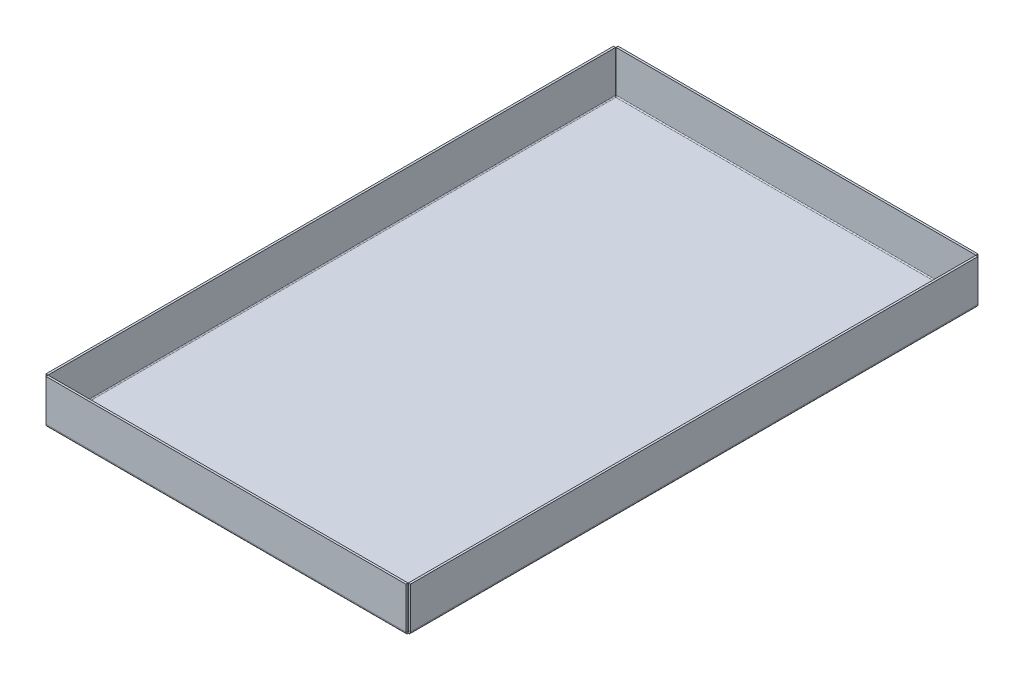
ISO-10303-21;
HEADER;
FILE_DESCRIPTION(('STEP AP214'),'2;1');
FILE_NAME('part.step','',(''),(''),'','','');
FILE_SCHEMA(('AUTOMOTIVE_DESIGN { 1 0 10303 214 1 1 1 1 }'));
ENDSEC;
DATA;
#1=APPLICATION_CONTEXT('core data for automotive mechanical design processes');
#2=APPLICATION_PROTOCOL_DEFINITION('international standard','automotive_design',2000,#1);
#3=PRODUCT_CONTEXT('',#1,'mechanical');
#4=PRODUCT('Part','Part','',(#3));
#5=PRODUCT_RELATED_PRODUCT_CATEGORY('part','',(#4));
#6=PRODUCT_DEFINITION_FORMATION('','',#4);
#7=PRODUCT_DEFINITION_CONTEXT('part definition',#1,'design');
#8=PRODUCT_DEFINITION('design','',#6,#7);
#9=PRODUCT_DEFINITION_SHAPE('','',#8);
#10=(LENGTH_UNIT() NAMED_UNIT(*) SI_UNIT(.MILLI.,.METRE.));
#11=(NAMED_UNIT(*) PLANE_ANGLE_UNIT() SI_UNIT($,.RADIAN.));
#12=(NAMED_UNIT(*) SI_UNIT($,.STERADIAN.) SOLID_ANGLE_UNIT());
#13=UNCERTAINTY_MEASURE_WITH_UNIT(LENGTH_MEASURE(1.E-05),#10,'distance_accuracy_value','');
#14=(GEOMETRIC_REPRESENTATION_CONTEXT(3) GLOBAL_UNCERTAINTY_ASSIGNED_CONTEXT((#13)) GLOBAL_UNIT_ASSIGNED_CONTEXT((#10,
#11,#12)) REPRESENTATION_CONTEXT('',''));
#15=CARTESIAN_POINT('',(0.,0.,0.));
#16=DIRECTION('',(0.,0.,1.));
#17=DIRECTION('',(1.,0.,0.));
#18=AXIS2_PLACEMENT_3D('',#15,#16,#17);
#19=CARTESIAN_POINT('',(-86.,1.66533453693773E-13,270.));
#20=DIRECTION('',(0.,-1.,0.));
#21=DIRECTION('',(0.,0.,-1.));
#22=AXIS2_PLACEMENT_3D('',#19,#20,#21);
#23=PLANE('',#22);
#24=DIRECTION('',(0.,0.,-1.));
#25=VECTOR('',#24,1.);
#26=CARTESIAN_POINT('',(84.5000000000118,1.66533453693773E-13,1619.99999999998));
#27=LINE('',#26,#25);
#28=CARTESIAN_POINT('',(84.5000000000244,1.66533453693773E-13,268.500000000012));
#29=VERTEX_POINT('',#28);
#30=CARTESIAN_POINT('',(84.4999999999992,0.,1.49999999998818));
#31=VERTEX_POINT('',#30);
#32=EDGE_CURVE('E646',#29,#31,#27,.T.);
#33=ORIENTED_EDGE('',*,*,#32,.F.);
#34=DIRECTION('',(1.,0.,0.));
#35=VECTOR('',#34,1.);
#36=CARTESIAN_POINT('',(-85.9999999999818,1.66533453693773E-13,268.500000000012));
#37=LINE('',#36,#35);
#38=CARTESIAN_POINT('',(-84.5000000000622,0.,268.500000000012));
#39=VERTEX_POINT('',#38);
#40=EDGE_CURVE('E761',#39,#29,#37,.T.);
#41=ORIENTED_EDGE('',*,*,#40,.F.);
#42=DIRECTION('',(0.,0.,1.));
#43=VECTOR('',#42,1.);
#44=CARTESIAN_POINT('',(-84.5000000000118,0.,1.82076576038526E-11));
#45=LINE('',#44,#43);
#46=CARTESIAN_POINT('',(-84.5000000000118,-1.66533453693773E-13,1.49999999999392));
#47=VERTEX_POINT('',#46);
#48=EDGE_CURVE('E575',#47,#39,#45,.T.);
#49=ORIENTED_EDGE('',*,*,#48,.F.);
#50=DIRECTION('',(-1.,0.,0.));
#51=VECTOR('',#50,1.);
#52=CARTESIAN_POINT('',(85.9999999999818,-1.66533453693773E-13,1.49999999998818));
#53=LINE('',#52,#51);
#54=EDGE_CURVE('E623',#31,#47,#53,.T.);
#55=ORIENTED_EDGE('',*,*,#54,.F.);
#56=EDGE_LOOP('',(#33,#41,#49,#55));
#57=FACE_BOUND('',#56,.T.);
#58=ADVANCED_FACE('F356',(#57),#23,.T.);
#59=CARTESIAN_POINT('',(-86.,1.00000000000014,270.));
#60=DIRECTION('',(0.,-1.,0.));
#61=DIRECTION('',(0.,0.,-1.));
#62=AXIS2_PLACEMENT_3D('',#59,#60,#61);
#63=PLANE('',#62);
#64=DIRECTION('',(1.,0.,0.));
#65=VECTOR('',#64,1.);
#66=CARTESIAN_POINT('',(-85.9999999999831,1.00000000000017,268.500000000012));
#67=LINE('',#66,#65);
#68=CARTESIAN_POINT('',(-84.5000000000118,1.,268.500000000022));
#69=VERTEX_POINT('',#68);
#70=CARTESIAN_POINT('',(84.5000000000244,1.00000000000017,268.500000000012));
#71=VERTEX_POINT('',#70);
#72=EDGE_CURVE('E535',#69,#71,#67,.T.);
#73=ORIENTED_EDGE('',*,*,#72,.T.);
#74=DIRECTION('',(0.,0.,-1.));
#75=VECTOR('',#74,1.);
#76=CARTESIAN_POINT('',(84.5000000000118,1.00000000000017,1619.99999999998));
#77=LINE('',#76,#75);
#78=CARTESIAN_POINT('',(84.5000000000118,1.,1.49999999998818));
#79=VERTEX_POINT('',#78);
#80=EDGE_CURVE('E657',#71,#79,#77,.T.);
#81=ORIENTED_EDGE('',*,*,#80,.T.);
#82=DIRECTION('',(-1.,0.,0.));
#83=VECTOR('',#82,1.);
#84=CARTESIAN_POINT('',(85.9999999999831,0.999999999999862,1.49999999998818));
#85=LINE('',#84,#83);
#86=CARTESIAN_POINT('',(-84.5000000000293,0.999999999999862,1.49999999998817));
#87=VERTEX_POINT('',#86);
#88=EDGE_CURVE('E636',#79,#87,#85,.T.);
#89=ORIENTED_EDGE('',*,*,#88,.T.);
#90=DIRECTION('',(0.,0.,1.));
#91=VECTOR('',#90,1.);
#92=CARTESIAN_POINT('',(-84.5000000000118,1.,1.69309011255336E-11));
#93=LINE('',#92,#91);
#94=EDGE_CURVE('E586',#87,#69,#93,.T.);
#95=ORIENTED_EDGE('',*,*,#94,.T.);
#96=EDGE_LOOP('',(#73,#81,#89,#95));
#97=FACE_BOUND('',#96,.T.);
#98=ADVANCED_FACE('F358',(#97),#63,.F.);
#99=CARTESIAN_POINT('',(86.,21.,1620.));
#100=DIRECTION('',(6.06657581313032E-13,-1.,0.));
#101=DIRECTION('',(0.,0.,-1.));
#102=AXIS2_PLACEMENT_3D('',#99,#100,#101);
#103=PLANE('',#102);
#104=DIRECTION('',(1.,6.06657581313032E-13,0.));
#105=VECTOR('',#104,1.);
#106=CARTESIAN_POINT('',(86.,21.,1.06066017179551));
#107=LINE('',#106,#105);
#108=CARTESIAN_POINT('',(86.,21.,1.06066017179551));
#109=VERTEX_POINT('',#108);
#110=CARTESIAN_POINT('',(85.,20.9999999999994,1.06066017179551));
#111=VERTEX_POINT('',#110);
#112=EDGE_CURVE('E11',#109,#111,#107,.F.);
#113=ORIENTED_EDGE('',*,*,#112,.T.);
#114=DIRECTION('',(0.,0.,1.));
#115=VECTOR('',#114,1.);
#116=CARTESIAN_POINT('',(85.,20.9999999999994,1620.));
#117=LINE('',#116,#115);
#118=CARTESIAN_POINT('',(85.,20.9999999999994,268.939339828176));
#119=VERTEX_POINT('',#118);
#120=EDGE_CURVE('E682',#119,#111,#117,.F.);
#121=ORIENTED_EDGE('',*,*,#120,.F.);
#122=DIRECTION('',(1.,6.06657581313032E-13,0.));
#123=VECTOR('',#122,1.);
#124=CARTESIAN_POINT('',(86.,21.,268.939339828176));
#125=LINE('',#124,#123);
#126=CARTESIAN_POINT('',(86.,21.,268.939339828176));
#127=VERTEX_POINT('',#126);
#128=EDGE_CURVE('E365',#127,#119,#125,.F.);
#129=ORIENTED_EDGE('',*,*,#128,.F.);
#130=DIRECTION('',(0.,0.,-1.));
#131=VECTOR('',#130,1.);
#132=CARTESIAN_POINT('',(86.,21.,1620.));
#133=LINE('',#132,#131);
#134=EDGE_CURVE('E669',#127,#109,#133,.T.);
#135=ORIENTED_EDGE('',*,*,#134,.T.);
#136=EDGE_LOOP('',(#113,#121,#129,#135));
#137=FACE_BOUND('',#136,.T.);
#138=ADVANCED_FACE('F702',(#137),#103,.F.);
#139=CARTESIAN_POINT('',(86.,20.9999999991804,268.93933982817));
#140=DIRECTION('',(0.,6.06657581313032E-13,1.));
#141=DIRECTION('',(6.06657581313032E-13,-1.,6.06657581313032E-13));
#142=AXIS2_PLACEMENT_3D('',#139,#140,#141);
#143=PLANE('',#142);
#144=ORIENTED_EDGE('',*,*,#128,.T.);
#145=DIRECTION('',(-6.06657581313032E-13,1.,0.));
#146=VECTOR('',#145,1.);
#147=CARTESIAN_POINT('',(85.,20.9999999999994,268.939339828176));
#148=LINE('',#147,#146);
#149=CARTESIAN_POINT('',(85.0000000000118,1.50000000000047,268.939339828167));
#150=VERTEX_POINT('',#149);
#151=EDGE_CURVE('E686',#119,#150,#148,.F.);
#152=ORIENTED_EDGE('',*,*,#151,.T.);
#153=DIRECTION('',(1.,6.06657581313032E-13,0.));
#154=VECTOR('',#153,1.);
#155=CARTESIAN_POINT('',(86.0000000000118,1.50000000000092,268.939339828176));
#156=LINE('',#155,#154);
#157=CARTESIAN_POINT('',(86.0000000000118,1.50000000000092,268.939339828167));
#158=VERTEX_POINT('',#157);
#159=EDGE_CURVE('E691',#158,#150,#156,.F.);
#160=ORIENTED_EDGE('',*,*,#159,.F.);
#161=DIRECTION('',(6.06657581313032E-13,-1.,6.06657581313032E-13));
#162=VECTOR('',#161,1.);
#163=CARTESIAN_POINT('',(86.,20.9999999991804,268.93933982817));
#164=LINE('',#163,#162);
#165=EDGE_CURVE('E677',#127,#158,#164,.T.);
#166=ORIENTED_EDGE('',*,*,#165,.F.);
#167=EDGE_LOOP('',(#144,#152,#160,#166));
#168=FACE_BOUND('',#167,.T.);
#169=ADVANCED_FACE('F698',(#168),#143,.T.);
#170=CARTESIAN_POINT('',(86.,21.0000000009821,1.06066017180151));
#171=DIRECTION('',(0.,6.06657581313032E-13,-1.));
#172=DIRECTION('',(-6.06657581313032E-13,1.,6.06657581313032E-13));
#173=AXIS2_PLACEMENT_3D('',#170,#171,#172);
#174=PLANE('',#173);
#175=DIRECTION('',(-6.06657581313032E-13,1.,6.06657581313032E-13));
#176=VECTOR('',#175,1.);
#177=CARTESIAN_POINT('',(86.,21.0000000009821,1.06066017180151));
#178=LINE('',#177,#176);
#179=CARTESIAN_POINT('',(86.0000000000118,1.50000000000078,1.06066017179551));
#180=VERTEX_POINT('',#179);
#181=EDGE_CURVE('E680',#180,#109,#178,.T.);
#182=ORIENTED_EDGE('',*,*,#181,.F.);
#183=DIRECTION('',(1.,6.06657581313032E-13,0.));
#184=VECTOR('',#183,1.);
#185=CARTESIAN_POINT('',(86.0000000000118,1.50000000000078,1.06066017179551));
#186=LINE('',#185,#184);
#187=CARTESIAN_POINT('',(85.0000000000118,1.50000000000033,1.0606601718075));
#188=VERTEX_POINT('',#187);
#189=EDGE_CURVE('E360',#180,#188,#186,.F.);
#190=ORIENTED_EDGE('',*,*,#189,.T.);
#191=DIRECTION('',(-6.06657581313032E-13,1.,0.));
#192=VECTOR('',#191,1.);
#193=CARTESIAN_POINT('',(85.,20.9999999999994,1.06066017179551));
#194=LINE('',#193,#192);
#195=EDGE_CURVE('E380',#188,#111,#194,.T.);
#196=ORIENTED_EDGE('',*,*,#195,.T.);
#197=ORIENTED_EDGE('',*,*,#112,.F.);
#198=EDGE_LOOP('',(#182,#190,#196,#197));
#199=FACE_BOUND('',#198,.T.);
#200=ADVANCED_FACE('F722',(#199),#174,.T.);
#201=CARTESIAN_POINT('',(85.,20.9999999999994,1620.));
#202=DIRECTION('',(1.,6.06657581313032E-13,0.));
#203=DIRECTION('',(-6.06657581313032E-13,1.,0.));
#204=AXIS2_PLACEMENT_3D('',#201,#202,#203);
#205=PLANE('',#204);
#206=DIRECTION('',(0.,0.,1.));
#207=VECTOR('',#206,1.);
#208=CARTESIAN_POINT('',(85.0000000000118,1.50000000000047,1620.));
#209=LINE('',#208,#207);
#210=EDGE_CURVE('E683',#150,#188,#209,.F.);
#211=ORIENTED_EDGE('',*,*,#210,.F.);
#212=ORIENTED_EDGE('',*,*,#151,.F.);
#213=ORIENTED_EDGE('',*,*,#120,.T.);
#214=ORIENTED_EDGE('',*,*,#195,.F.);
#215=EDGE_LOOP('',(#211,#212,#213,#214));
#216=FACE_BOUND('',#215,.T.);
#217=ADVANCED_FACE('F705',(#216),#205,.F.);
#218=CARTESIAN_POINT('',(86.,21.,1620.));
#219=DIRECTION('',(1.,6.06657581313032E-13,0.));
#220=DIRECTION('',(-6.06657581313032E-13,1.,0.));
#221=AXIS2_PLACEMENT_3D('',#218,#219,#220);
#222=PLANE('',#221);
#223=DIRECTION('',(0.,0.,-1.));
#224=VECTOR('',#223,1.);
#225=CARTESIAN_POINT('',(86.0000000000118,1.50000000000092,1619.99999999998));
#226=LINE('',#225,#224);
#227=EDGE_CURVE('E674',#158,#180,#226,.T.);
#228=ORIENTED_EDGE('',*,*,#227,.T.);
#229=ORIENTED_EDGE('',*,*,#181,.T.);
#230=ORIENTED_EDGE('',*,*,#134,.F.);
#231=ORIENTED_EDGE('',*,*,#165,.T.);
#232=EDGE_LOOP('',(#228,#229,#230,#231));
#233=FACE_BOUND('',#232,.T.);
#234=ADVANCED_FACE('F721',(#233),#222,.T.);
#235=CARTESIAN_POINT('',(83.0000000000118,1.50000000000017,268.060660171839));
#236=CARTESIAN_POINT('',(83.3333333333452,1.50000000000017,268.060660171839));
#237=CARTESIAN_POINT('',(83.6666666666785,1.50000000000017,268.060660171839));
#238=CARTESIAN_POINT('',(84.0000000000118,1.50000000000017,268.060660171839));
#239=CARTESIAN_POINT('',(83.0000000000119,4.5,268.060660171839));
#240=CARTESIAN_POINT('',(83.3333333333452,3.83333333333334,268.060660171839));
#241=CARTESIAN_POINT('',(83.6666666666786,3.16666666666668,268.060660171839));
#242=CARTESIAN_POINT('',(84.0000000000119,2.50000000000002,268.060660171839));
#243=CARTESIAN_POINT('',(86.0000000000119,4.5,268.939339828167));
#244=CARTESIAN_POINT('',(85.6666666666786,3.83333333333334,268.939339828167));
#245=CARTESIAN_POINT('',(85.3333333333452,3.16666666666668,268.939339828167));
#246=CARTESIAN_POINT('',(85.0000000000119,2.5,268.939339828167));
#247=CARTESIAN_POINT('',(86.0000000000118,1.5,268.939339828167));
#248=CARTESIAN_POINT('',(85.6666666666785,1.50000000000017,268.939339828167));
#249=CARTESIAN_POINT('',(85.3333333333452,1.50000000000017,268.939339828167));
#250=CARTESIAN_POINT('',(85.0000000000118,1.50000000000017,268.939339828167));
#251=CARTESIAN_POINT('',(86.0000000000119,-1.5,268.939339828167));
#252=CARTESIAN_POINT('',(85.6666666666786,-0.833333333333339,268.939339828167));
#253=CARTESIAN_POINT('',(85.3333333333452,-0.166666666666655,268.939339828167));
#254=CARTESIAN_POINT('',(85.0000000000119,0.500000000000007,268.939339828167));
#255=CARTESIAN_POINT('',(83.0000000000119,-1.5,268.060660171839));
#256=CARTESIAN_POINT('',(83.3333333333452,-0.833333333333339,268.060660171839));
#257=CARTESIAN_POINT('',(83.6666666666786,-0.166666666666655,268.060660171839));
#258=CARTESIAN_POINT('',(84.0000000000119,0.500000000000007,268.060660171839));
#259=CARTESIAN_POINT('',(83.0000000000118,1.50000000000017,268.060660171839));
#260=CARTESIAN_POINT('',(83.3333333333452,1.50000000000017,268.060660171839));
#261=CARTESIAN_POINT('',(83.6666666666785,1.50000000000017,268.060660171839));
#262=CARTESIAN_POINT('',(84.0000000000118,1.50000000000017,268.060660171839));
#263=(BOUNDED_SURFACE() B_SPLINE_SURFACE(3,3,((#235,#236,#237,#238),(#239,#240,#241,#242),(#243,
#244,#245,#246),(#247,#248,#249,#250),(#251,#252,#253,#254),(#255,#256,#257,#258),(#259,#260,
#261,#262)),.UNSPECIFIED.,.T.,.F.,.F.) B_SPLINE_SURFACE_WITH_KNOTS((4,3,4),(4,4),(0.,0.5,1.),
(0.,1.),.UNSPECIFIED.) GEOMETRIC_REPRESENTATION_ITEM() RATIONAL_B_SPLINE_SURFACE(((1.,1.,1.,1.),
(0.333333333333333,0.333333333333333,0.333333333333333,0.333333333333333),(0.333333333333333,
0.333333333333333,0.333333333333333,0.333333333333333),(1.,1.,1.,1.),(0.333333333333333,
0.333333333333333,0.333333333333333,0.333333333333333),(0.333333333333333,0.333333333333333,
0.333333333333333,0.333333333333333),(1.,1.,1.,1.))) REPRESENTATION_ITEM('') SURFACE());
#264=CARTESIAN_POINT('',(84.5000000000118,1.50000000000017,268.500000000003));
#265=DIRECTION('',(-0.660068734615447,0.,0.75120520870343));
#266=DIRECTION('',(-0.75120520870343,0.,-0.660068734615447));
#267=AXIS2_PLACEMENT_3D('',#264,#265,#266);
#268=ELLIPSE('',#267,0.665597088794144,0.5);
#269=EDGE_CURVE('E660',#150,#71,#268,.F.);
#270=DIRECTION('',(0.,-1.,0.));
#271=VECTOR('',#270,1.);
#272=CARTESIAN_POINT('',(84.5000000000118,1.66533453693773E-13,268.500000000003));
#273=LINE('',#272,#271);
#274=EDGE_CURVE('E666',#29,#71,#273,.F.);
#275=CARTESIAN_POINT('',(84.5000000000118,1.50000000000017,268.500000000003));
#276=DIRECTION('',(-0.281084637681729,0.,0.95968298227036));
#277=DIRECTION('',(-0.95968298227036,0.,-0.281084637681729));
#278=AXIS2_PLACEMENT_3D('',#275,#276,#277);
#279=ELLIPSE('',#278,1.56301614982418,1.5);
#280=EDGE_CURVE('E651',#158,#29,#279,.F.);
#281=ORIENTED_EDGE('',*,*,#159,.T.);
#282=ORIENTED_EDGE('',*,*,#269,.T.);
#283=ORIENTED_EDGE('',*,*,#274,.F.);
#284=ORIENTED_EDGE('',*,*,#280,.F.);
#285=EDGE_LOOP('',(#281,#282,#283,#284));
#286=FACE_BOUND('',#285,.T.);
#287=ADVANCED_FACE('F713',(#286),#263,.F.);
#288=CARTESIAN_POINT('',(86.0000000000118,1.49999999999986,1.06066017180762));
#289=CARTESIAN_POINT('',(85.6666666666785,1.50000000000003,1.06066017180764));
#290=CARTESIAN_POINT('',(85.3333333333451,1.50000000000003,1.06066017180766));
#291=CARTESIAN_POINT('',(85.0000000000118,1.50000000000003,1.06066017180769));
#292=CARTESIAN_POINT('',(86.0000000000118,4.5,1.06066017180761));
#293=CARTESIAN_POINT('',(85.6666666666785,3.83333333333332,1.06066017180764));
#294=CARTESIAN_POINT('',(85.3333333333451,3.16666666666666,1.06066017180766));
#295=CARTESIAN_POINT('',(85.0000000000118,2.5,1.06066017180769));
#296=CARTESIAN_POINT('',(83.0000000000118,4.5,1.93933982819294));
#297=CARTESIAN_POINT('',(83.3333333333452,3.83333333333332,1.93933982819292));
#298=CARTESIAN_POINT('',(83.6666666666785,3.16666666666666,1.93933982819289));
#299=CARTESIAN_POINT('',(84.0000000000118,2.5,1.93933982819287));
#300=CARTESIAN_POINT('',(83.0000000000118,1.50000000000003,1.93933982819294));
#301=CARTESIAN_POINT('',(83.3333333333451,1.50000000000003,1.93933982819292));
#302=CARTESIAN_POINT('',(83.6666666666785,1.50000000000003,1.93933982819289));
#303=CARTESIAN_POINT('',(84.0000000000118,1.50000000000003,1.93933982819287));
#304=CARTESIAN_POINT('',(83.0000000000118,-1.5,1.93933982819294));
#305=CARTESIAN_POINT('',(83.3333333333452,-0.833333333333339,1.93933982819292));
#306=CARTESIAN_POINT('',(83.6666666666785,-0.166666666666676,1.9393398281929));
#307=CARTESIAN_POINT('',(84.0000000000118,0.499999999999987,1.93933982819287));
#308=CARTESIAN_POINT('',(86.0000000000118,-1.5,1.06066017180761));
#309=CARTESIAN_POINT('',(85.6666666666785,-0.833333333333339,1.06066017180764));
#310=CARTESIAN_POINT('',(85.3333333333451,-0.166666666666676,1.06066017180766));
#311=CARTESIAN_POINT('',(85.0000000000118,0.499999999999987,1.06066017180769));
#312=CARTESIAN_POINT('',(86.0000000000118,1.49999999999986,1.06066017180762));
#313=CARTESIAN_POINT('',(85.6666666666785,1.50000000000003,1.06066017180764));
#314=CARTESIAN_POINT('',(85.3333333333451,1.50000000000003,1.06066017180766));
#315=CARTESIAN_POINT('',(85.0000000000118,1.50000000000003,1.06066017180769));
#316=(BOUNDED_SURFACE() B_SPLINE_SURFACE(3,3,((#288,#289,#290,#291),(#292,#293,#294,#295),(#296,
#297,#298,#299),(#300,#301,#302,#303),(#304,#305,#306,#307),(#308,#309,#310,#311),(#312,#313,
#314,#315)),.UNSPECIFIED.,.T.,.F.,.F.) B_SPLINE_SURFACE_WITH_KNOTS((4,3,4),(4,4),(0.,0.5,1.),
(0.,1.),.UNSPECIFIED.) GEOMETRIC_REPRESENTATION_ITEM() RATIONAL_B_SPLINE_SURFACE(((1.,1.,1.,1.),
(0.333333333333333,0.333333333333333,0.333333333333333,0.333333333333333),(0.333333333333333,
0.333333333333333,0.333333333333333,0.333333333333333),(1.,1.,1.,1.),(0.333333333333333,
0.333333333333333,0.333333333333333,0.333333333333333),(0.333333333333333,0.333333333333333,
0.333333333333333,0.333333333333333),(1.,1.,1.,1.))) REPRESENTATION_ITEM('') SURFACE());
#317=CARTESIAN_POINT('',(84.5000000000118,1.50000000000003,1.50000000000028));
#318=DIRECTION('',(-0.281084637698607,0.,-0.959682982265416));
#319=DIRECTION('',(0.959682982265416,0.,-0.281084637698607));
#320=AXIS2_PLACEMENT_3D('',#317,#318,#319);
#321=ELLIPSE('',#320,1.56301614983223,1.5);
#322=EDGE_CURVE('E654',#31,#180,#321,.F.);
#323=DIRECTION('',(0.,-1.,0.));
#324=VECTOR('',#323,1.);
#325=CARTESIAN_POINT('',(84.5000000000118,0.,1.50000000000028));
#326=LINE('',#325,#324);
#327=EDGE_CURVE('E665',#31,#79,#326,.F.);
#328=CARTESIAN_POINT('',(84.5000000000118,1.50000000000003,1.50000000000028));
#329=DIRECTION('',(-0.660068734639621,0.,-0.751205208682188));
#330=DIRECTION('',(0.751205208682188,0.,-0.660068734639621));
#331=AXIS2_PLACEMENT_3D('',#328,#329,#330);
#332=ELLIPSE('',#331,0.665597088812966,0.5);
#333=EDGE_CURVE('E663',#79,#188,#332,.F.);
#334=ORIENTED_EDGE('',*,*,#322,.F.);
#335=ORIENTED_EDGE('',*,*,#327,.T.);
#336=ORIENTED_EDGE('',*,*,#333,.T.);
#337=ORIENTED_EDGE('',*,*,#189,.F.);
#338=EDGE_LOOP('',(#334,#335,#336,#337));
#339=FACE_BOUND('',#338,.T.);
#340=ADVANCED_FACE('F724',(#339),#316,.F.);
#341=CARTESIAN_POINT('',(84.5000000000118,1.50000000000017,1619.99999999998));
#342=DIRECTION('',(0.,0.,-1.));
#343=DIRECTION('',(-1.,0.,0.));
#344=AXIS2_PLACEMENT_3D('',#341,#342,#343);
#345=CYLINDRICAL_SURFACE('',#344,0.5);
#346=ORIENTED_EDGE('',*,*,#80,.F.);
#347=ORIENTED_EDGE('',*,*,#269,.F.);
#348=ORIENTED_EDGE('',*,*,#210,.T.);
#349=ORIENTED_EDGE('',*,*,#333,.F.);
#350=EDGE_LOOP('',(#346,#347,#348,#349));
#351=FACE_BOUND('',#350,.T.);
#352=ADVANCED_FACE('F709',(#351),#345,.F.);
#353=CARTESIAN_POINT('',(84.5000000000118,1.50000000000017,1619.99999999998));
#354=DIRECTION('',(0.,0.,-1.));
#355=DIRECTION('',(-1.,0.,0.));
#356=AXIS2_PLACEMENT_3D('',#353,#354,#355);
#357=CYLINDRICAL_SURFACE('',#356,1.5);
#358=ORIENTED_EDGE('',*,*,#32,.T.);
#359=ORIENTED_EDGE('',*,*,#322,.T.);
#360=ORIENTED_EDGE('',*,*,#227,.F.);
#361=ORIENTED_EDGE('',*,*,#280,.T.);
#362=EDGE_LOOP('',(#358,#359,#360,#361));
#363=FACE_BOUND('',#362,.T.);
#364=ADVANCED_FACE('F717',(#363),#357,.T.);
#365=CARTESIAN_POINT('',(1436.,21.,0.));
#366=DIRECTION('',(0.,-1.,-6.06657581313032E-13));
#367=DIRECTION('',(-1.,0.,0.));
#368=AXIS2_PLACEMENT_3D('',#365,#366,#367);
#369=PLANE('',#368);
#370=DIRECTION('',(0.,6.06657581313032E-13,-1.));
#371=VECTOR('',#370,1.);
#372=CARTESIAN_POINT('',(-84.9393398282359,21.,0.));
#373=LINE('',#372,#371);
#374=CARTESIAN_POINT('',(-84.9393398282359,21.,0.));
#375=VERTEX_POINT('',#374);
#376=CARTESIAN_POINT('',(-84.9393398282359,20.9999999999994,0.999999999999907));
#377=VERTEX_POINT('',#376);
#378=EDGE_CURVE('E596',#375,#377,#373,.F.);
#379=ORIENTED_EDGE('',*,*,#378,.T.);
#380=DIRECTION('',(1.,0.,0.));
#381=VECTOR('',#380,1.);
#382=CARTESIAN_POINT('',(1436.,20.9999999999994,1.));
#383=LINE('',#382,#381);
#384=CARTESIAN_POINT('',(84.9393398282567,20.9999999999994,0.999999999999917));
#385=VERTEX_POINT('',#384);
#386=EDGE_CURVE('E614',#385,#377,#383,.F.);
#387=ORIENTED_EDGE('',*,*,#386,.F.);
#388=DIRECTION('',(0.,6.06657581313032E-13,-1.));
#389=VECTOR('',#388,1.);
#390=CARTESIAN_POINT('',(84.9393398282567,21.,0.));
#391=LINE('',#390,#389);
#392=CARTESIAN_POINT('',(84.9393398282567,21.,0.));
#393=VERTEX_POINT('',#392);
#394=EDGE_CURVE('E607',#393,#385,#391,.F.);
#395=ORIENTED_EDGE('',*,*,#394,.F.);
#396=DIRECTION('',(-1.,0.,0.));
#397=VECTOR('',#396,1.);
#398=CARTESIAN_POINT('',(1436.,21.,0.));
#399=LINE('',#398,#397);
#400=EDGE_CURVE('E606',#393,#375,#399,.T.);
#401=ORIENTED_EDGE('',*,*,#400,.T.);
#402=EDGE_LOOP('',(#379,#387,#395,#401));
#403=FACE_BOUND('',#402,.T.);
#404=ADVANCED_FACE('F791',(#403),#369,.F.);
#405=CARTESIAN_POINT('',(84.9393398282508,20.9999999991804,0.));
#406=DIRECTION('',(1.,6.06657581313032E-13,0.));
#407=DIRECTION('',(6.06657581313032E-13,-1.,-6.06657581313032E-13));
#408=AXIS2_PLACEMENT_3D('',#405,#406,#407);
#409=PLANE('',#408);
#410=ORIENTED_EDGE('',*,*,#394,.T.);
#411=DIRECTION('',(0.,1.,6.06657581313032E-13));
#412=VECTOR('',#411,1.);
#413=CARTESIAN_POINT('',(84.9393398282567,20.9999999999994,0.999999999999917));
#414=LINE('',#413,#412);
#415=CARTESIAN_POINT('',(84.9393398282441,1.50000000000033,0.999999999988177));
#416=VERTEX_POINT('',#415);
#417=EDGE_CURVE('E603',#385,#416,#414,.F.);
#418=ORIENTED_EDGE('',*,*,#417,.T.);
#419=DIRECTION('',(0.,6.06657581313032E-13,-1.));
#420=VECTOR('',#419,1.);
#421=CARTESIAN_POINT('',(84.9393398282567,1.50000000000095,-1.19066010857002E-11));
#422=LINE('',#421,#420);
#423=CARTESIAN_POINT('',(84.9393398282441,1.50000000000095,-1.18238752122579E-11));
#424=VERTEX_POINT('',#423);
#425=EDGE_CURVE('E610',#424,#416,#422,.F.);
#426=ORIENTED_EDGE('',*,*,#425,.F.);
#427=DIRECTION('',(6.06657581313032E-13,-1.,-6.06657581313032E-13));
#428=VECTOR('',#427,1.);
#429=CARTESIAN_POINT('',(84.9393398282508,20.9999999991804,0.));
#430=LINE('',#429,#428);
#431=EDGE_CURVE('E612',#393,#424,#430,.T.);
#432=ORIENTED_EDGE('',*,*,#431,.F.);
#433=EDGE_LOOP('',(#410,#418,#426,#432));
#434=FACE_BOUND('',#433,.T.);
#435=ADVANCED_FACE('F738',(#434),#409,.T.);
#436=CARTESIAN_POINT('',(-84.9393398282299,21.0000000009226,0.));
#437=DIRECTION('',(-1.,6.06657581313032E-13,0.));
#438=DIRECTION('',(6.06657581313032E-13,1.,6.06657581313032E-13));
#439=AXIS2_PLACEMENT_3D('',#436,#437,#438);
#440=PLANE('',#439);
#441=DIRECTION('',(6.06657581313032E-13,1.,6.06657581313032E-13));
#442=VECTOR('',#441,1.);
#443=CARTESIAN_POINT('',(-84.9393398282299,21.0000000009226,0.));
#444=LINE('',#443,#442);
#445=CARTESIAN_POINT('',(-84.9393398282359,1.50000000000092,-1.19170028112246E-11));
#446=VERTEX_POINT('',#445);
#447=EDGE_CURVE('E625',#446,#375,#444,.T.);
#448=ORIENTED_EDGE('',*,*,#447,.F.);
#449=DIRECTION('',(0.,6.06657581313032E-13,-1.));
#450=VECTOR('',#449,1.);
#451=CARTESIAN_POINT('',(-84.9393398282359,1.50000000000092,-1.19170028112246E-11));
#452=LINE('',#451,#450);
#453=CARTESIAN_POINT('',(-84.9393398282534,1.50000000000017,0.999999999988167));
#454=VERTEX_POINT('',#453);
#455=EDGE_CURVE('E599',#446,#454,#452,.F.);
#456=ORIENTED_EDGE('',*,*,#455,.T.);
#457=DIRECTION('',(0.,1.,6.06657581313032E-13));
#458=VECTOR('',#457,1.);
#459=CARTESIAN_POINT('',(-84.9393398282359,20.9999999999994,0.999999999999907));
#460=LINE('',#459,#458);
#461=EDGE_CURVE('E602',#454,#377,#460,.T.);
#462=ORIENTED_EDGE('',*,*,#461,.T.);
#463=ORIENTED_EDGE('',*,*,#378,.F.);
#464=EDGE_LOOP('',(#448,#456,#462,#463));
#465=FACE_BOUND('',#464,.T.);
#466=ADVANCED_FACE('F788',(#465),#440,.T.);
#467=CARTESIAN_POINT('',(1436.,20.9999999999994,1.));
#468=DIRECTION('',(0.,6.06657581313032E-13,-1.));
#469=DIRECTION('',(0.,1.,6.06657581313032E-13));
#470=AXIS2_PLACEMENT_3D('',#467,#468,#469);
#471=PLANE('',#470);
#472=DIRECTION('',(1.,0.,0.));
#473=VECTOR('',#472,1.);
#474=CARTESIAN_POINT('',(1436.,1.50000000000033,0.99999999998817));
#475=LINE('',#474,#473);
#476=EDGE_CURVE('E620',#416,#454,#475,.F.);
#477=ORIENTED_EDGE('',*,*,#476,.F.);
#478=ORIENTED_EDGE('',*,*,#417,.F.);
#479=ORIENTED_EDGE('',*,*,#386,.T.);
#480=ORIENTED_EDGE('',*,*,#461,.F.);
#481=EDGE_LOOP('',(#477,#478,#479,#480));
#482=FACE_BOUND('',#481,.T.);
#483=ADVANCED_FACE('F741',(#482),#471,.F.);
#484=CARTESIAN_POINT('',(1436.,21.,0.));
#485=DIRECTION('',(0.,6.06657581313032E-13,-1.));
#486=DIRECTION('',(0.,1.,6.06657581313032E-13));
#487=AXIS2_PLACEMENT_3D('',#484,#485,#486);
#488=PLANE('',#487);
#489=DIRECTION('',(-1.,0.,0.));
#490=VECTOR('',#489,1.);
#491=CARTESIAN_POINT('',(1435.99999999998,1.50000000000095,-1.1823875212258E-11));
#492=LINE('',#491,#490);
#493=EDGE_CURVE('E617',#424,#446,#492,.T.);
#494=ORIENTED_EDGE('',*,*,#493,.T.);
#495=ORIENTED_EDGE('',*,*,#447,.T.);
#496=ORIENTED_EDGE('',*,*,#400,.F.);
#497=ORIENTED_EDGE('',*,*,#431,.T.);
#498=EDGE_LOOP('',(#494,#495,#496,#497));
#499=FACE_BOUND('',#498,.T.);
#500=ADVANCED_FACE('F735',(#499),#488,.T.);
#501=CARTESIAN_POINT('',(84.0606601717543,1.50000000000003,2.99999999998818));
#502=CARTESIAN_POINT('',(84.0606601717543,1.50000000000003,2.66666666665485));
#503=CARTESIAN_POINT('',(84.0606601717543,1.50000000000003,2.33333333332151));
#504=CARTESIAN_POINT('',(84.0606601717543,1.50000000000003,1.99999999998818));
#505=CARTESIAN_POINT('',(84.0606601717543,4.5,2.99999999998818));
#506=CARTESIAN_POINT('',(84.0606601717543,3.83333333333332,2.66666666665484));
#507=CARTESIAN_POINT('',(84.0606601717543,3.16666666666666,2.33333333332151));
#508=CARTESIAN_POINT('',(84.0606601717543,2.5,1.99999999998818));
#509=CARTESIAN_POINT('',(84.9393398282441,4.5,-1.18227247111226E-11));
#510=CARTESIAN_POINT('',(84.9393398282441,3.83333333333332,0.333333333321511));
#511=CARTESIAN_POINT('',(84.9393398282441,3.16666666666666,0.666666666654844));
#512=CARTESIAN_POINT('',(84.9393398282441,2.5,0.999999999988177));
#513=CARTESIAN_POINT('',(84.9393398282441,1.50000000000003,-1.18223573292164E-11));
#514=CARTESIAN_POINT('',(84.939339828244,1.50000000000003,0.333333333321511));
#515=CARTESIAN_POINT('',(84.939339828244,1.50000000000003,0.666666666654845));
#516=CARTESIAN_POINT('',(84.9393398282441,1.50000000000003,0.999999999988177));
#517=CARTESIAN_POINT('',(84.9393398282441,-1.5,-1.18219899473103E-11));
#518=CARTESIAN_POINT('',(84.9393398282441,-0.833333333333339,0.333333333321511));
#519=CARTESIAN_POINT('',(84.9393398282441,-0.166666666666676,0.666666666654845));
#520=CARTESIAN_POINT('',(84.9393398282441,0.499999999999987,0.999999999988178));
#521=CARTESIAN_POINT('',(84.0606601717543,-1.5,2.99999999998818));
#522=CARTESIAN_POINT('',(84.0606601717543,-0.833333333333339,2.66666666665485));
#523=CARTESIAN_POINT('',(84.0606601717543,-0.166666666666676,2.33333333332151));
#524=CARTESIAN_POINT('',(84.0606601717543,0.499999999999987,1.99999999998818));
#525=CARTESIAN_POINT('',(84.0606601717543,1.50000000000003,2.99999999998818));
#526=CARTESIAN_POINT('',(84.0606601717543,1.50000000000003,2.66666666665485));
#527=CARTESIAN_POINT('',(84.0606601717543,1.50000000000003,2.33333333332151));
#528=CARTESIAN_POINT('',(84.0606601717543,1.50000000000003,1.99999999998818));
#529=(BOUNDED_SURFACE() B_SPLINE_SURFACE(3,3,((#501,#502,#503,#504),(#505,#506,#507,#508),(#509,
#510,#511,#512),(#513,#514,#515,#516),(#517,#518,#519,#520),(#521,#522,#523,#524),(#525,#526,
#527,#528)),.UNSPECIFIED.,.T.,.F.,.F.) B_SPLINE_SURFACE_WITH_KNOTS((4,3,4),(4,4),(0.,0.5,1.),
(0.,1.),.UNSPECIFIED.) GEOMETRIC_REPRESENTATION_ITEM() RATIONAL_B_SPLINE_SURFACE(((1.,1.,1.,1.),
(0.333333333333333,0.333333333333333,0.333333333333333,0.333333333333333),(0.333333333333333,
0.333333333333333,0.333333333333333,0.333333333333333),(1.,1.,1.,1.),(0.333333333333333,
0.333333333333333,0.333333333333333,0.333333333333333),(0.333333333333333,0.333333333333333,
0.333333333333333,0.333333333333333),(1.,1.,1.,1.))) REPRESENTATION_ITEM('') SURFACE());
#530=CARTESIAN_POINT('',(84.4999999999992,1.50000000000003,1.49999999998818));
#531=DIRECTION('',(0.751205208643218,0.,0.660068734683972));
#532=DIRECTION('',(-0.660068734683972,0.,0.751205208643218));
#533=AXIS2_PLACEMENT_3D('',#530,#531,#532);
#534=ELLIPSE('',#533,0.665597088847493,0.5);
#535=EDGE_CURVE('E372',#416,#79,#534,.F.);
#536=CARTESIAN_POINT('',(84.4999999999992,1.50000000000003,1.49999999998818));
#537=DIRECTION('',(0.9596829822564,0.,0.281084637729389));
#538=DIRECTION('',(-0.281084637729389,0.,0.9596829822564));
#539=AXIS2_PLACEMENT_3D('',#536,#537,#538);
#540=ELLIPSE('',#539,1.56301614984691,1.5);
#541=EDGE_CURVE('E644',#424,#31,#540,.F.);
#542=ORIENTED_EDGE('',*,*,#425,.T.);
#543=ORIENTED_EDGE('',*,*,#535,.T.);
#544=ORIENTED_EDGE('',*,*,#327,.F.);
#545=ORIENTED_EDGE('',*,*,#541,.F.);
#546=EDGE_LOOP('',(#542,#543,#544,#545));
#547=FACE_BOUND('',#546,.T.);
#548=ADVANCED_FACE('F725',(#547),#529,.F.);
#549=CARTESIAN_POINT('',(-84.9393398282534,1.5,-1.18329825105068E-11));
#550=CARTESIAN_POINT('',(-84.9393398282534,1.49999999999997,0.3333333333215));
#551=CARTESIAN_POINT('',(-84.9393398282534,1.49999999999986,0.666666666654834));
#552=CARTESIAN_POINT('',(-84.9393398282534,1.49999999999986,0.999999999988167));
#553=CARTESIAN_POINT('',(-84.9393398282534,4.5,-1.18329825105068E-11));
#554=CARTESIAN_POINT('',(-84.9393398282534,3.83333333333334,0.333333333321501));
#555=CARTESIAN_POINT('',(-84.9393398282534,3.16666666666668,0.666666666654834));
#556=CARTESIAN_POINT('',(-84.9393398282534,2.50000000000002,0.999999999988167));
#557=CARTESIAN_POINT('',(-84.0606601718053,4.5,2.99999999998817));
#558=CARTESIAN_POINT('',(-84.0606601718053,3.83333333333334,2.66666666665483));
#559=CARTESIAN_POINT('',(-84.0606601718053,3.16666666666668,2.3333333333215));
#560=CARTESIAN_POINT('',(-84.0606601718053,2.50000000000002,1.99999999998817));
#561=CARTESIAN_POINT('',(-84.0606601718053,1.49999999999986,2.99999999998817));
#562=CARTESIAN_POINT('',(-84.0606601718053,1.49999999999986,2.66666666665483));
#563=CARTESIAN_POINT('',(-84.0606601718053,1.49999999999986,2.3333333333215));
#564=CARTESIAN_POINT('',(-84.0606601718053,1.49999999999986,1.99999999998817));
#565=CARTESIAN_POINT('',(-84.0606601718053,-1.5,2.99999999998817));
#566=CARTESIAN_POINT('',(-84.0606601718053,-0.833333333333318,2.66666666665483));
#567=CARTESIAN_POINT('',(-84.0606601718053,-0.166666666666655,2.3333333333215));
#568=CARTESIAN_POINT('',(-84.0606601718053,0.500000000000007,1.99999999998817));
#569=CARTESIAN_POINT('',(-84.9393398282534,-1.49999999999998,-1.18329825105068E-11));
#570=CARTESIAN_POINT('',(-84.9393398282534,-0.833333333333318,0.333333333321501));
#571=CARTESIAN_POINT('',(-84.9393398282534,-0.166666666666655,0.666666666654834));
#572=CARTESIAN_POINT('',(-84.9393398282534,0.500000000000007,0.999999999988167));
#573=CARTESIAN_POINT('',(-84.9393398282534,1.5,-1.18329825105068E-11));
#574=CARTESIAN_POINT('',(-84.9393398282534,1.49999999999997,0.3333333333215));
#575=CARTESIAN_POINT('',(-84.9393398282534,1.49999999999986,0.666666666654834));
#576=CARTESIAN_POINT('',(-84.9393398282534,1.49999999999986,0.999999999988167));
#577=(BOUNDED_SURFACE() B_SPLINE_SURFACE(3,3,((#549,#550,#551,#552),(#553,#554,#555,#556),(#557,
#558,#559,#560),(#561,#562,#563,#564),(#565,#566,#567,#568),(#569,#570,#571,#572),(#573,#574,
#575,#576)),.UNSPECIFIED.,.T.,.F.,.F.) B_SPLINE_SURFACE_WITH_KNOTS((4,3,4),(4,4),(0.,0.5,1.),
(0.,1.),.UNSPECIFIED.) GEOMETRIC_REPRESENTATION_ITEM() RATIONAL_B_SPLINE_SURFACE(((1.,1.,1.,1.),
(0.333333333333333,0.333333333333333,0.333333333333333,0.333333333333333),(0.333333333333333,
0.333333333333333,0.333333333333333,0.333333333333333),(1.,1.,1.,1.),(0.333333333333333,
0.333333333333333,0.333333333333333,0.333333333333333),(0.333333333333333,0.333333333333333,
0.333333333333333,0.333333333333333),(1.,1.,1.,1.))) REPRESENTATION_ITEM('') SURFACE());
#578=CARTESIAN_POINT('',(-84.5000000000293,1.49999999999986,1.49999999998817));
#579=DIRECTION('',(-0.959682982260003,0.,0.281084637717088));
#580=DIRECTION('',(-0.281084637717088,0.,-0.959682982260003));
#581=AXIS2_PLACEMENT_3D('',#578,#579,#580);
#582=ELLIPSE('',#581,1.56301614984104,1.5);
#583=EDGE_CURVE('E641',#47,#446,#582,.F.);
#584=DIRECTION('',(0.,-1.,0.));
#585=VECTOR('',#584,1.);
#586=CARTESIAN_POINT('',(-84.5000000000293,-1.66533453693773E-13,1.49999999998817));
#587=LINE('',#586,#585);
#588=EDGE_CURVE('E633',#47,#87,#587,.F.);
#589=CARTESIAN_POINT('',(-84.5000000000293,1.49999999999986,1.49999999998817));
#590=DIRECTION('',(-0.751205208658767,0.,0.660068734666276));
#591=DIRECTION('',(-0.660068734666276,0.,-0.751205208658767));
#592=AXIS2_PLACEMENT_3D('',#589,#590,#591);
#593=ELLIPSE('',#592,0.665597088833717,0.5);
#594=EDGE_CURVE('E624',#87,#454,#593,.F.);
#595=ORIENTED_EDGE('',*,*,#583,.F.);
#596=ORIENTED_EDGE('',*,*,#588,.T.);
#597=ORIENTED_EDGE('',*,*,#594,.T.);
#598=ORIENTED_EDGE('',*,*,#455,.F.);
#599=EDGE_LOOP('',(#595,#596,#597,#598));
#600=FACE_BOUND('',#599,.T.);
#601=ADVANCED_FACE('F786',(#600),#577,.F.);
#602=CARTESIAN_POINT('',(85.9999999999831,1.49999999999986,1.49999999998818));
#603=DIRECTION('',(-1.,0.,0.));
#604=DIRECTION('',(0.,0.,1.));
#605=AXIS2_PLACEMENT_3D('',#602,#603,#604);
#606=CYLINDRICAL_SURFACE('',#605,0.5);
#607=ORIENTED_EDGE('',*,*,#88,.F.);
#608=ORIENTED_EDGE('',*,*,#535,.F.);
#609=ORIENTED_EDGE('',*,*,#476,.T.);
#610=ORIENTED_EDGE('',*,*,#594,.F.);
#611=EDGE_LOOP('',(#607,#608,#609,#610));
#612=FACE_BOUND('',#611,.T.);
#613=ADVANCED_FACE('F745',(#612),#606,.F.);
#614=CARTESIAN_POINT('',(85.9999999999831,1.49999999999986,1.49999999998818));
#615=DIRECTION('',(-1.,0.,0.));
#616=DIRECTION('',(0.,0.,1.));
#617=AXIS2_PLACEMENT_3D('',#614,#615,#616);
#618=CYLINDRICAL_SURFACE('',#617,1.5);
#619=ORIENTED_EDGE('',*,*,#54,.T.);
#620=ORIENTED_EDGE('',*,*,#583,.T.);
#621=ORIENTED_EDGE('',*,*,#493,.F.);
#622=ORIENTED_EDGE('',*,*,#541,.T.);
#623=EDGE_LOOP('',(#619,#620,#621,#622));
#624=FACE_BOUND('',#623,.T.);
#625=ADVANCED_FACE('F730',(#624),#618,.T.);
#626=CARTESIAN_POINT('',(-86.,21.,-1350.));
#627=DIRECTION('',(-6.06657581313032E-13,-1.,0.));
#628=DIRECTION('',(0.,0.,1.));
#629=AXIS2_PLACEMENT_3D('',#626,#627,#628);
#630=PLANE('',#629);
#631=DIRECTION('',(-1.,6.06657581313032E-13,0.));
#632=VECTOR('',#631,1.);
#633=CARTESIAN_POINT('',(-86.0000000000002,21.,268.939339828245));
#634=LINE('',#633,#632);
#635=CARTESIAN_POINT('',(-86.0000000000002,21.,268.939339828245));
#636=VERTEX_POINT('',#635);
#637=CARTESIAN_POINT('',(-85.0000000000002,20.9999999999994,268.939339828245));
#638=VERTEX_POINT('',#637);
#639=EDGE_CURVE('E508',#636,#638,#634,.F.);
#640=ORIENTED_EDGE('',*,*,#639,.T.);
#641=DIRECTION('',(0.,0.,-1.));
#642=VECTOR('',#641,1.);
#643=CARTESIAN_POINT('',(-85.,20.9999999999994,-1350.));
#644=LINE('',#643,#642);
#645=CARTESIAN_POINT('',(-85.0000000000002,20.9999999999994,1.06066017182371));
#646=VERTEX_POINT('',#645);
#647=EDGE_CURVE('E566',#646,#638,#644,.F.);
#648=ORIENTED_EDGE('',*,*,#647,.F.);
#649=DIRECTION('',(-1.,6.06657581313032E-13,0.));
#650=VECTOR('',#649,1.);
#651=CARTESIAN_POINT('',(-86.0000000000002,21.,1.06066017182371));
#652=LINE('',#651,#650);
#653=CARTESIAN_POINT('',(-86.0000000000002,21.,1.06066017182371));
#654=VERTEX_POINT('',#653);
#655=EDGE_CURVE('E557',#654,#646,#652,.F.);
#656=ORIENTED_EDGE('',*,*,#655,.F.);
#657=DIRECTION('',(0.,0.,1.));
#658=VECTOR('',#657,1.);
#659=CARTESIAN_POINT('',(-86.,21.,-1350.));
#660=LINE('',#659,#658);
#661=EDGE_CURVE('E556',#654,#636,#660,.T.);
#662=ORIENTED_EDGE('',*,*,#661,.T.);
#663=EDGE_LOOP('',(#640,#648,#656,#662));
#664=FACE_BOUND('',#663,.T.);
#665=ADVANCED_FACE('F838',(#664),#630,.F.);
#666=CARTESIAN_POINT('',(-86.0000000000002,20.9999999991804,1.06066017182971));
#667=DIRECTION('',(0.,6.06657581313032E-13,-1.));
#668=DIRECTION('',(-6.06657581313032E-13,-1.,-6.06657581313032E-13));
#669=AXIS2_PLACEMENT_3D('',#666,#667,#668);
#670=PLANE('',#669);
#671=ORIENTED_EDGE('',*,*,#655,.T.);
#672=DIRECTION('',(6.06657581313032E-13,1.,0.));
#673=VECTOR('',#672,1.);
#674=CARTESIAN_POINT('',(-85.0000000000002,20.9999999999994,1.06066017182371));
#675=LINE('',#674,#673);
#676=CARTESIAN_POINT('',(-85.0000000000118,1.50000000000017,1.06066017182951));
#677=VERTEX_POINT('',#676);
#678=EDGE_CURVE('E553',#646,#677,#675,.F.);
#679=ORIENTED_EDGE('',*,*,#678,.T.);
#680=DIRECTION('',(-1.,6.06657581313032E-13,0.));
#681=VECTOR('',#680,1.);
#682=CARTESIAN_POINT('',(-86.000000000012,1.50000000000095,1.06066017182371));
#683=LINE('',#682,#681);
#684=CARTESIAN_POINT('',(-86.0000000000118,1.50000000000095,1.06066017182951));
#685=VERTEX_POINT('',#684);
#686=EDGE_CURVE('E560',#685,#677,#683,.F.);
#687=ORIENTED_EDGE('',*,*,#686,.F.);
#688=DIRECTION('',(-6.06657581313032E-13,-1.,-6.06657581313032E-13));
#689=VECTOR('',#688,1.);
#690=CARTESIAN_POINT('',(-86.0000000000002,20.9999999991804,1.06066017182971));
#691=LINE('',#690,#689);
#692=EDGE_CURVE('E564',#654,#685,#691,.T.);
#693=ORIENTED_EDGE('',*,*,#692,.F.);
#694=EDGE_LOOP('',(#671,#679,#687,#693));
#695=FACE_BOUND('',#694,.T.);
#696=ADVANCED_FACE('F904',(#695),#670,.T.);
#697=CARTESIAN_POINT('',(-86.0000000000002,21.0000000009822,268.939339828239));
#698=DIRECTION('',(0.,6.06657581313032E-13,1.));
#699=DIRECTION('',(6.06657581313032E-13,1.,-6.06657581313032E-13));
#700=AXIS2_PLACEMENT_3D('',#697,#698,#699);
#701=PLANE('',#700);
#702=DIRECTION('',(6.06657581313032E-13,1.,-6.06657581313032E-13));
#703=VECTOR('',#702,1.);
#704=CARTESIAN_POINT('',(-86.0000000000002,21.0000000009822,268.939339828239));
#705=LINE('',#704,#703);
#706=CARTESIAN_POINT('',(-86.000000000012,1.50000000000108,268.939339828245));
#707=VERTEX_POINT('',#706);
#708=EDGE_CURVE('E577',#707,#636,#705,.T.);
#709=ORIENTED_EDGE('',*,*,#708,.F.);
#710=DIRECTION('',(-1.,6.06657581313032E-13,0.));
#711=VECTOR('',#710,1.);
#712=CARTESIAN_POINT('',(-86.000000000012,1.50000000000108,268.939339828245));
#713=LINE('',#712,#711);
#714=CARTESIAN_POINT('',(-85.0000000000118,1.50000000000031,268.939339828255));
#715=VERTEX_POINT('',#714);
#716=EDGE_CURVE('E549',#707,#715,#713,.F.);
#717=ORIENTED_EDGE('',*,*,#716,.T.);
#718=DIRECTION('',(6.06657581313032E-13,1.,0.));
#719=VECTOR('',#718,1.);
#720=CARTESIAN_POINT('',(-85.0000000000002,20.9999999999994,268.939339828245));
#721=LINE('',#720,#719);
#722=EDGE_CURVE('E552',#715,#638,#721,.T.);
#723=ORIENTED_EDGE('',*,*,#722,.T.);
#724=ORIENTED_EDGE('',*,*,#639,.F.);
#725=EDGE_LOOP('',(#709,#717,#723,#724));
#726=FACE_BOUND('',#725,.T.);
#727=ADVANCED_FACE('F902',(#726),#701,.T.);
#728=CARTESIAN_POINT('',(-85.,20.9999999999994,-1350.));
#729=DIRECTION('',(-1.,6.06657581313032E-13,0.));
#730=DIRECTION('',(6.06657581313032E-13,1.,0.));
#731=AXIS2_PLACEMENT_3D('',#728,#729,#730);
#732=PLANE('',#731);
#733=DIRECTION('',(0.,0.,-1.));
#734=VECTOR('',#733,1.);
#735=CARTESIAN_POINT('',(-85.0000000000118,1.50000000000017,-1350.));
#736=LINE('',#735,#734);
#737=EDGE_CURVE('E572',#677,#715,#736,.F.);
#738=ORIENTED_EDGE('',*,*,#737,.F.);
#739=ORIENTED_EDGE('',*,*,#678,.F.);
#740=ORIENTED_EDGE('',*,*,#647,.T.);
#741=ORIENTED_EDGE('',*,*,#722,.F.);
#742=EDGE_LOOP('',(#738,#739,#740,#741));
#743=FACE_BOUND('',#742,.T.);
#744=ADVANCED_FACE('F898',(#743),#732,.F.);
#745=CARTESIAN_POINT('',(-86.,21.,-1350.));
#746=DIRECTION('',(-1.,6.06657581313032E-13,0.));
#747=DIRECTION('',(6.06657581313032E-13,1.,0.));
#748=AXIS2_PLACEMENT_3D('',#745,#746,#747);
#749=PLANE('',#748);
#750=DIRECTION('',(0.,0.,1.));
#751=VECTOR('',#750,1.);
#752=CARTESIAN_POINT('',(-86.0000000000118,1.50000000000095,-1349.99999999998));
#753=LINE('',#752,#751);
#754=EDGE_CURVE('E569',#685,#707,#753,.T.);
#755=ORIENTED_EDGE('',*,*,#754,.T.);
#756=ORIENTED_EDGE('',*,*,#708,.T.);
#757=ORIENTED_EDGE('',*,*,#661,.F.);
#758=ORIENTED_EDGE('',*,*,#692,.T.);
#759=EDGE_LOOP('',(#755,#756,#757,#758));
#760=FACE_BOUND('',#759,.T.);
#761=ADVANCED_FACE('F880',(#760),#749,.T.);
#762=CARTESIAN_POINT('',(-83.0000000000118,1.49999999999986,1.93933982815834));
#763=CARTESIAN_POINT('',(-83.3333333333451,1.49999999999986,1.93933982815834));
#764=CARTESIAN_POINT('',(-83.6666666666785,1.49999999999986,1.93933982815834));
#765=CARTESIAN_POINT('',(-84.0000000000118,1.49999999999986,1.93933982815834));
#766=CARTESIAN_POINT('',(-83.0000000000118,4.5,1.93933982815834));
#767=CARTESIAN_POINT('',(-83.3333333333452,3.83333333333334,1.93933982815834));
#768=CARTESIAN_POINT('',(-83.6666666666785,3.16666666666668,1.93933982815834));
#769=CARTESIAN_POINT('',(-84.0000000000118,2.50000000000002,1.93933982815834));
#770=CARTESIAN_POINT('',(-86.0000000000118,4.5,1.06066017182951));
#771=CARTESIAN_POINT('',(-85.6666666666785,3.83333333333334,1.06066017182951));
#772=CARTESIAN_POINT('',(-85.3333333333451,3.16666666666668,1.06066017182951));
#773=CARTESIAN_POINT('',(-85.0000000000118,2.50000000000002,1.06066017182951));
#774=CARTESIAN_POINT('',(-86.0000000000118,1.50000000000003,1.06066017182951));
#775=CARTESIAN_POINT('',(-85.6666666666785,1.49999999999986,1.06066017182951));
#776=CARTESIAN_POINT('',(-85.3333333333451,1.49999999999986,1.06066017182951));
#777=CARTESIAN_POINT('',(-85.0000000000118,1.49999999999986,1.06066017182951));
#778=CARTESIAN_POINT('',(-86.0000000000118,-1.5,1.06066017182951));
#779=CARTESIAN_POINT('',(-85.6666666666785,-0.833333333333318,1.06066017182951));
#780=CARTESIAN_POINT('',(-85.3333333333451,-0.166666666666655,1.06066017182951));
#781=CARTESIAN_POINT('',(-85.0000000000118,0.500000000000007,1.06066017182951));
#782=CARTESIAN_POINT('',(-83.0000000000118,-1.49999999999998,1.93933982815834));
#783=CARTESIAN_POINT('',(-83.3333333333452,-0.833333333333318,1.93933982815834));
#784=CARTESIAN_POINT('',(-83.6666666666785,-0.166666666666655,1.93933982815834));
#785=CARTESIAN_POINT('',(-84.0000000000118,0.500000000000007,1.93933982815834));
#786=CARTESIAN_POINT('',(-83.0000000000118,1.49999999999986,1.93933982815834));
#787=CARTESIAN_POINT('',(-83.3333333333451,1.49999999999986,1.93933982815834));
#788=CARTESIAN_POINT('',(-83.6666666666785,1.49999999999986,1.93933982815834));
#789=CARTESIAN_POINT('',(-84.0000000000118,1.49999999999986,1.93933982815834));
#790=(BOUNDED_SURFACE() B_SPLINE_SURFACE(3,3,((#762,#763,#764,#765),(#766,#767,#768,#769),(#770,
#771,#772,#773),(#774,#775,#776,#777),(#778,#779,#780,#781),(#782,#783,#784,#785),(#786,#787,
#788,#789)),.UNSPECIFIED.,.T.,.F.,.F.) B_SPLINE_SURFACE_WITH_KNOTS((4,3,4),(4,4),(0.,0.5,1.),
(0.,1.),.UNSPECIFIED.) GEOMETRIC_REPRESENTATION_ITEM() RATIONAL_B_SPLINE_SURFACE(((1.,1.,1.,1.),
(0.333333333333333,0.333333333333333,0.333333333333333,0.333333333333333),(0.333333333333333,
0.333333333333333,0.333333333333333,0.333333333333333),(1.,1.,1.,1.),(0.333333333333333,
0.333333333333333,0.333333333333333,0.333333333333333),(0.333333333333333,0.333333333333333,
0.333333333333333,0.333333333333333),(1.,1.,1.,1.))) REPRESENTATION_ITEM('') SURFACE());
#791=CARTESIAN_POINT('',(-84.5000000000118,1.49999999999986,1.49999999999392));
#792=DIRECTION('',(0.660068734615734,0.,-0.751205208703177));
#793=DIRECTION('',(0.751205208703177,0.,0.660068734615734));
#794=AXIS2_PLACEMENT_3D('',#791,#792,#793);
#795=ELLIPSE('',#794,0.665597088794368,0.5);
#796=EDGE_CURVE('E563',#677,#87,#795,.F.);
#797=CARTESIAN_POINT('',(-84.5000000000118,1.49999999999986,1.49999999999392));
#798=DIRECTION('',(0.281084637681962,0.,-0.959682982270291));
#799=DIRECTION('',(0.959682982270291,0.,0.281084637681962));
#800=AXIS2_PLACEMENT_3D('',#797,#798,#799);
#801=ELLIPSE('',#800,1.56301614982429,1.5);
#802=EDGE_CURVE('E594',#685,#47,#801,.F.);
#803=ORIENTED_EDGE('',*,*,#686,.T.);
#804=ORIENTED_EDGE('',*,*,#796,.T.);
#805=ORIENTED_EDGE('',*,*,#588,.F.);
#806=ORIENTED_EDGE('',*,*,#802,.F.);
#807=EDGE_LOOP('',(#803,#804,#805,#806));
#808=FACE_BOUND('',#807,.T.);
#809=ADVANCED_FACE('F784',(#808),#790,.F.);
#810=CARTESIAN_POINT('',(-86.0000000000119,1.50000000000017,268.939339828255));
#811=CARTESIAN_POINT('',(-85.6666666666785,1.5,268.939339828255));
#812=CARTESIAN_POINT('',(-85.3333333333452,1.5,268.939339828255));
#813=CARTESIAN_POINT('',(-85.0000000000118,1.5,268.939339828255));
#814=CARTESIAN_POINT('',(-86.0000000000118,4.50000000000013,268.939339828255));
#815=CARTESIAN_POINT('',(-85.6666666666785,3.83333333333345,268.939339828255));
#816=CARTESIAN_POINT('',(-85.3333333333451,3.16666666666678,268.939339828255));
#817=CARTESIAN_POINT('',(-85.0000000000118,2.50000000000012,268.939339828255));
#818=CARTESIAN_POINT('',(-83.0000000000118,4.50000000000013,268.060660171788));
#819=CARTESIAN_POINT('',(-83.3333333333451,3.83333333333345,268.060660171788));
#820=CARTESIAN_POINT('',(-83.6666666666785,3.16666666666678,268.060660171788));
#821=CARTESIAN_POINT('',(-84.0000000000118,2.50000000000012,268.060660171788));
#822=CARTESIAN_POINT('',(-83.0000000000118,1.5,268.060660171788));
#823=CARTESIAN_POINT('',(-83.3333333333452,1.5,268.060660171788));
#824=CARTESIAN_POINT('',(-83.6666666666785,1.5,268.060660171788));
#825=CARTESIAN_POINT('',(-84.0000000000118,1.5,268.060660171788));
#826=CARTESIAN_POINT('',(-83.0000000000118,-1.49999999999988,268.060660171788));
#827=CARTESIAN_POINT('',(-83.3333333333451,-0.833333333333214,268.060660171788));
#828=CARTESIAN_POINT('',(-83.6666666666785,-0.166666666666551,268.060660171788));
#829=CARTESIAN_POINT('',(-84.0000000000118,0.500000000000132,268.060660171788));
#830=CARTESIAN_POINT('',(-86.0000000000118,-1.49999999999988,268.939339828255));
#831=CARTESIAN_POINT('',(-85.6666666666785,-0.833333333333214,268.939339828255));
#832=CARTESIAN_POINT('',(-85.3333333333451,-0.166666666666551,268.939339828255));
#833=CARTESIAN_POINT('',(-85.0000000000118,0.500000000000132,268.939339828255));
#834=CARTESIAN_POINT('',(-86.0000000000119,1.50000000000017,268.939339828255));
#835=CARTESIAN_POINT('',(-85.6666666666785,1.5,268.939339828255));
#836=CARTESIAN_POINT('',(-85.3333333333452,1.5,268.939339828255));
#837=CARTESIAN_POINT('',(-85.0000000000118,1.5,268.939339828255));
#838=(BOUNDED_SURFACE() B_SPLINE_SURFACE(3,3,((#810,#811,#812,#813),(#814,#815,#816,#817),(#818,
#819,#820,#821),(#822,#823,#824,#825),(#826,#827,#828,#829),(#830,#831,#832,#833),(#834,#835,
#836,#837)),.UNSPECIFIED.,.T.,.F.,.F.) B_SPLINE_SURFACE_WITH_KNOTS((4,3,4),(4,4),(0.,0.5,1.),
(0.,1.),.UNSPECIFIED.) GEOMETRIC_REPRESENTATION_ITEM() RATIONAL_B_SPLINE_SURFACE(((1.,1.,1.,1.),
(0.333333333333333,0.333333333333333,0.333333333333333,0.333333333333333),(0.333333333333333,
0.333333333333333,0.333333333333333,0.333333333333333),(1.,1.,1.,1.),(0.333333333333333,
0.333333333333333,0.333333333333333,0.333333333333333),(0.333333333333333,0.333333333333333,
0.333333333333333,0.333333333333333),(1.,1.,1.,1.))) REPRESENTATION_ITEM('') SURFACE());
#839=CARTESIAN_POINT('',(-84.5000000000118,1.5,268.500000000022));
#840=DIRECTION('',(0.281084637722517,0.,0.959682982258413));
#841=DIRECTION('',(-0.959682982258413,0.,0.281084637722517));
#842=AXIS2_PLACEMENT_3D('',#839,#840,#841);
#843=ELLIPSE('',#842,1.56301614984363,1.5);
#844=EDGE_CURVE('E591',#39,#707,#843,.F.);
#845=DIRECTION('',(0.,-1.,0.));
#846=VECTOR('',#845,1.);
#847=CARTESIAN_POINT('',(-84.5000000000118,0.,268.500000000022));
#848=LINE('',#847,#846);
#849=EDGE_CURVE('E504',#39,#69,#848,.F.);
#850=CARTESIAN_POINT('',(-84.5000000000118,1.5,268.500000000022));
#851=DIRECTION('',(0.660068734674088,0.,0.751205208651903));
#852=DIRECTION('',(-0.751205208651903,0.,0.660068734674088));
#853=AXIS2_PLACEMENT_3D('',#850,#851,#852);
#854=ELLIPSE('',#853,0.665597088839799,0.5);
#855=EDGE_CURVE('E576',#69,#715,#854,.F.);
#856=ORIENTED_EDGE('',*,*,#844,.F.);
#857=ORIENTED_EDGE('',*,*,#849,.T.);
#858=ORIENTED_EDGE('',*,*,#855,.T.);
#859=ORIENTED_EDGE('',*,*,#716,.F.);
#860=EDGE_LOOP('',(#856,#857,#858,#859));
#861=FACE_BOUND('',#860,.T.);
#862=ADVANCED_FACE('F874',(#861),#838,.F.);
#863=CARTESIAN_POINT('',(-84.5000000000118,1.5,1.69309011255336E-11));
#864=DIRECTION('',(0.,0.,1.));
#865=DIRECTION('',(1.,0.,0.));
#866=AXIS2_PLACEMENT_3D('',#863,#864,#865);
#867=CYLINDRICAL_SURFACE('',#866,0.5);
#868=ORIENTED_EDGE('',*,*,#94,.F.);
#869=ORIENTED_EDGE('',*,*,#796,.F.);
#870=ORIENTED_EDGE('',*,*,#737,.T.);
#871=ORIENTED_EDGE('',*,*,#855,.F.);
#872=EDGE_LOOP('',(#868,#869,#870,#871));
#873=FACE_BOUND('',#872,.T.);
#874=ADVANCED_FACE('F871',(#873),#867,.F.);
#875=CARTESIAN_POINT('',(-84.5000000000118,1.5,1.69309011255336E-11));
#876=DIRECTION('',(0.,0.,1.));
#877=DIRECTION('',(1.,0.,0.));
#878=AXIS2_PLACEMENT_3D('',#875,#876,#877);
#879=CYLINDRICAL_SURFACE('',#878,1.5);
#880=ORIENTED_EDGE('',*,*,#48,.T.);
#881=ORIENTED_EDGE('',*,*,#844,.T.);
#882=ORIENTED_EDGE('',*,*,#754,.F.);
#883=ORIENTED_EDGE('',*,*,#802,.T.);
#884=EDGE_LOOP('',(#880,#881,#882,#883));
#885=FACE_BOUND('',#884,.T.);
#886=ADVANCED_FACE('F779',(#885),#879,.T.);
#887=CARTESIAN_POINT('',(-1436.,21.,270.));
#888=DIRECTION('',(0.,-1.,6.06657581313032E-13));
#889=DIRECTION('',(1.,0.,0.));
#890=AXIS2_PLACEMENT_3D('',#887,#888,#889);
#891=PLANE('',#890);
#892=DIRECTION('',(0.,6.06657581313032E-13,1.));
#893=VECTOR('',#892,1.);
#894=CARTESIAN_POINT('',(84.9393398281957,21.,270.));
#895=LINE('',#894,#893);
#896=CARTESIAN_POINT('',(84.9393398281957,21.,270.));
#897=VERTEX_POINT('',#896);
#898=CARTESIAN_POINT('',(84.9393398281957,20.9999999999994,269.));
#899=VERTEX_POINT('',#898);
#900=EDGE_CURVE('E543',#897,#899,#895,.F.);
#901=ORIENTED_EDGE('',*,*,#900,.T.);
#902=DIRECTION('',(-1.,0.,0.));
#903=VECTOR('',#902,1.);
#904=CARTESIAN_POINT('',(-1436.,20.9999999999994,269.));
#905=LINE('',#904,#903);
#906=CARTESIAN_POINT('',(-84.9393398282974,20.9999999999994,269.));
#907=VERTEX_POINT('',#906);
#908=EDGE_CURVE('E519',#907,#899,#905,.F.);
#909=ORIENTED_EDGE('',*,*,#908,.F.);
#910=DIRECTION('',(0.,6.06657581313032E-13,1.));
#911=VECTOR('',#910,1.);
#912=CARTESIAN_POINT('',(-84.9393398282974,21.,270.));
#913=LINE('',#912,#911);
#914=CARTESIAN_POINT('',(-84.9393398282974,21.,270.));
#915=VERTEX_POINT('',#914);
#916=EDGE_CURVE('E541',#915,#907,#913,.F.);
#917=ORIENTED_EDGE('',*,*,#916,.F.);
#918=DIRECTION('',(1.,0.,0.));
#919=VECTOR('',#918,1.);
#920=CARTESIAN_POINT('',(-1436.,21.,270.));
#921=LINE('',#920,#919);
#922=EDGE_CURVE('E525',#915,#897,#921,.T.);
#923=ORIENTED_EDGE('',*,*,#922,.T.);
#924=EDGE_LOOP('',(#901,#909,#917,#923));
#925=FACE_BOUND('',#924,.T.);
#926=ADVANCED_FACE('F870',(#925),#891,.F.);
#927=CARTESIAN_POINT('',(-84.9393398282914,20.9999999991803,270.));
#928=DIRECTION('',(-1.,6.06657581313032E-13,0.));
#929=DIRECTION('',(-6.06657581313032E-13,-1.,6.06657581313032E-13));
#930=AXIS2_PLACEMENT_3D('',#927,#928,#929);
#931=PLANE('',#930);
#932=ORIENTED_EDGE('',*,*,#916,.T.);
#933=DIRECTION('',(0.,1.,-6.06657581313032E-13));
#934=VECTOR('',#933,1.);
#935=CARTESIAN_POINT('',(-84.9393398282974,20.9999999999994,269.));
#936=LINE('',#935,#934);
#937=CARTESIAN_POINT('',(-84.9393398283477,1.50000000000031,269.000000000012));
#938=VERTEX_POINT('',#937);
#939=EDGE_CURVE('E532',#907,#938,#936,.F.);
#940=ORIENTED_EDGE('',*,*,#939,.T.);
#941=DIRECTION('',(0.,6.06657581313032E-13,1.));
#942=VECTOR('',#941,1.);
#943=CARTESIAN_POINT('',(-84.9393398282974,1.50000000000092,270.000000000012));
#944=LINE('',#943,#942);
#945=CARTESIAN_POINT('',(-84.9393398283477,1.50000000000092,270.000000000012));
#946=VERTEX_POINT('',#945);
#947=EDGE_CURVE('E501',#946,#938,#944,.F.);
#948=ORIENTED_EDGE('',*,*,#947,.F.);
#949=DIRECTION('',(-6.06657581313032E-13,-1.,6.06657581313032E-13));
#950=VECTOR('',#949,1.);
#951=CARTESIAN_POINT('',(-84.9393398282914,20.9999999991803,270.));
#952=LINE('',#951,#950);
#953=EDGE_CURVE('E522',#915,#946,#952,.T.);
#954=ORIENTED_EDGE('',*,*,#953,.F.);
#955=EDGE_LOOP('',(#932,#940,#948,#954));
#956=FACE_BOUND('',#955,.T.);
#957=ADVANCED_FACE('F531',(#956),#931,.T.);
#958=CARTESIAN_POINT('',(84.9393398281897,21.0000000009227,270.));
#959=DIRECTION('',(1.,6.06657581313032E-13,0.));
#960=DIRECTION('',(-6.06657581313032E-13,1.,-6.06657581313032E-13));
#961=AXIS2_PLACEMENT_3D('',#958,#959,#960);
#962=PLANE('',#961);
#963=DIRECTION('',(-6.06657581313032E-13,1.,-6.06657581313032E-13));
#964=VECTOR('',#963,1.);
#965=CARTESIAN_POINT('',(84.9393398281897,21.0000000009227,270.));
#966=LINE('',#965,#964);
#967=CARTESIAN_POINT('',(84.9393398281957,1.50000000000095,270.000000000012));
#968=VERTEX_POINT('',#967);
#969=EDGE_CURVE('E518',#968,#897,#966,.T.);
#970=ORIENTED_EDGE('',*,*,#969,.F.);
#971=DIRECTION('',(0.,6.06657581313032E-13,1.));
#972=VECTOR('',#971,1.);
#973=CARTESIAN_POINT('',(84.9393398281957,1.50000000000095,270.000000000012));
#974=LINE('',#973,#972);
#975=CARTESIAN_POINT('',(84.9393398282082,1.50000000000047,269.000000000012));
#976=VERTEX_POINT('',#975);
#977=EDGE_CURVE('E546',#968,#976,#974,.F.);
#978=ORIENTED_EDGE('',*,*,#977,.T.);
#979=DIRECTION('',(0.,1.,-6.06657581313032E-13));
#980=VECTOR('',#979,1.);
#981=CARTESIAN_POINT('',(84.9393398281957,20.9999999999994,269.));
#982=LINE('',#981,#980);
#983=EDGE_CURVE('E539',#976,#899,#982,.T.);
#984=ORIENTED_EDGE('',*,*,#983,.T.);
#985=ORIENTED_EDGE('',*,*,#900,.F.);
#986=EDGE_LOOP('',(#970,#978,#984,#985));
#987=FACE_BOUND('',#986,.T.);
#988=ADVANCED_FACE('F768',(#987),#962,.T.);
#989=CARTESIAN_POINT('',(-1436.,20.9999999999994,269.));
#990=DIRECTION('',(0.,6.06657581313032E-13,1.));
#991=DIRECTION('',(0.,1.,-6.06657581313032E-13));
#992=AXIS2_PLACEMENT_3D('',#989,#990,#991);
#993=PLANE('',#992);
#994=DIRECTION('',(-1.,0.,0.));
#995=VECTOR('',#994,1.);
#996=CARTESIAN_POINT('',(-1436.,1.50000000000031,269.000000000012));
#997=LINE('',#996,#995);
#998=EDGE_CURVE('E753',#938,#976,#997,.F.);
#999=ORIENTED_EDGE('',*,*,#998,.F.);
#1000=ORIENTED_EDGE('',*,*,#939,.F.);
#1001=ORIENTED_EDGE('',*,*,#908,.T.);
#1002=ORIENTED_EDGE('',*,*,#983,.F.);
#1003=EDGE_LOOP('',(#999,#1000,#1001,#1002));
#1004=FACE_BOUND('',#1003,.T.);
#1005=ADVANCED_FACE('F769',(#1004),#993,.F.);
#1006=CARTESIAN_POINT('',(-1436.,21.,270.));
#1007=DIRECTION('',(0.,6.06657581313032E-13,1.));
#1008=DIRECTION('',(0.,1.,-6.06657581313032E-13));
#1009=AXIS2_PLACEMENT_3D('',#1006,#1007,#1008);
#1010=PLANE('',#1009);
#1011=DIRECTION('',(1.,0.,0.));
#1012=VECTOR('',#1011,1.);
#1013=CARTESIAN_POINT('',(-1435.99999999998,1.50000000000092,270.000000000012));
#1014=LINE('',#1013,#1012);
#1015=EDGE_CURVE('E513',#946,#968,#1014,.T.);
#1016=ORIENTED_EDGE('',*,*,#1015,.T.);
#1017=ORIENTED_EDGE('',*,*,#969,.T.);
#1018=ORIENTED_EDGE('',*,*,#922,.F.);
#1019=ORIENTED_EDGE('',*,*,#953,.T.);
#1020=EDGE_LOOP('',(#1016,#1017,#1018,#1019));
#1021=FACE_BOUND('',#1020,.T.);
#1022=ADVANCED_FACE('F523',(#1021),#1010,.T.);
#1023=CARTESIAN_POINT('',(-84.0606601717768,1.5,267.000000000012));
#1024=CARTESIAN_POINT('',(-84.0606601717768,1.5,267.333333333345));
#1025=CARTESIAN_POINT('',(-84.0606601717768,1.5,267.666666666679));
#1026=CARTESIAN_POINT('',(-84.0606601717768,1.5,268.000000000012));
#1027=CARTESIAN_POINT('',(-84.0606601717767,4.50000000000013,267.000000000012));
#1028=CARTESIAN_POINT('',(-84.0606601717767,3.83333333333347,267.333333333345));
#1029=CARTESIAN_POINT('',(-84.0606601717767,3.16666666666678,267.666666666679));
#1030=CARTESIAN_POINT('',(-84.0606601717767,2.50000000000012,268.000000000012));
#1031=CARTESIAN_POINT('',(-84.9393398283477,4.50000000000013,270.000000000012));
#1032=CARTESIAN_POINT('',(-84.9393398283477,3.83333333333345,269.666666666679));
#1033=CARTESIAN_POINT('',(-84.9393398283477,3.16666666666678,269.333333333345));
#1034=CARTESIAN_POINT('',(-84.9393398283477,2.50000000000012,269.000000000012));
#1035=CARTESIAN_POINT('',(-84.9393398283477,1.5,270.000000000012));
#1036=CARTESIAN_POINT('',(-84.9393398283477,1.5,269.666666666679));
#1037=CARTESIAN_POINT('',(-84.9393398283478,1.5,269.333333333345));
#1038=CARTESIAN_POINT('',(-84.9393398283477,1.5,269.000000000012));
#1039=CARTESIAN_POINT('',(-84.9393398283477,-1.49999999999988,270.000000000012));
#1040=CARTESIAN_POINT('',(-84.9393398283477,-0.833333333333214,269.666666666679));
#1041=CARTESIAN_POINT('',(-84.9393398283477,-0.166666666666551,269.333333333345));
#1042=CARTESIAN_POINT('',(-84.9393398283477,0.500000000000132,269.000000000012));
#1043=CARTESIAN_POINT('',(-84.0606601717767,-1.49999999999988,267.000000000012));
#1044=CARTESIAN_POINT('',(-84.0606601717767,-0.833333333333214,267.333333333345));
#1045=CARTESIAN_POINT('',(-84.0606601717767,-0.166666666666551,267.666666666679));
#1046=CARTESIAN_POINT('',(-84.0606601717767,0.500000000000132,268.000000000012));
#1047=CARTESIAN_POINT('',(-84.0606601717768,1.5,267.000000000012));
#1048=CARTESIAN_POINT('',(-84.0606601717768,1.5,267.333333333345));
#1049=CARTESIAN_POINT('',(-84.0606601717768,1.5,267.666666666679));
#1050=CARTESIAN_POINT('',(-84.0606601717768,1.5,268.000000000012));
#1051=(BOUNDED_SURFACE() B_SPLINE_SURFACE(3,3,((#1023,#1024,#1025,#1026),(#1027,#1028,#1029,
#1030),(#1031,#1032,#1033,#1034),(#1035,#1036,#1037,#1038),(#1039,#1040,#1041,#1042),(#1043,
#1044,#1045,#1046),(#1047,#1048,#1049,#1050)),.UNSPECIFIED.,.T.,.F.,
.F.) B_SPLINE_SURFACE_WITH_KNOTS((4,3,4),(4,4),(0.,0.5,1.),(0.,1.),
.UNSPECIFIED.) GEOMETRIC_REPRESENTATION_ITEM() RATIONAL_B_SPLINE_SURFACE(((1.,1.,1.,1.),
(0.333333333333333,0.333333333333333,0.333333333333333,0.333333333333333),(0.333333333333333,
0.333333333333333,0.333333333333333,0.333333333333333),(1.,1.,1.,1.),(0.333333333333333,
0.333333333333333,0.333333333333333,0.333333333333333),(0.333333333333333,0.333333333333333,
0.333333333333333,0.333333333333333),(1.,1.,1.,1.))) REPRESENTATION_ITEM('') SURFACE());
#1052=CARTESIAN_POINT('',(-84.5000000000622,1.5,268.500000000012));
#1053=DIRECTION('',(-0.751205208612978,0.,-0.660068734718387));
#1054=DIRECTION('',(0.660068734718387,0.,-0.751205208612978));
#1055=AXIS2_PLACEMENT_3D('',#1052,#1053,#1054);
#1056=ELLIPSE('',#1055,0.665597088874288,0.5);
#1057=EDGE_CURVE('E533',#938,#69,#1056,.F.);
#1058=CARTESIAN_POINT('',(-84.5000000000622,1.5,268.500000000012));
#1059=DIRECTION('',(-0.959682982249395,0.,-0.281084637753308));
#1060=DIRECTION('',(0.281084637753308,0.,-0.959682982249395));
#1061=AXIS2_PLACEMENT_3D('',#1058,#1059,#1060);
#1062=ELLIPSE('',#1061,1.56301614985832,1.5);
#1063=EDGE_CURVE('E497',#946,#39,#1062,.F.);
#1064=ORIENTED_EDGE('',*,*,#947,.T.);
#1065=ORIENTED_EDGE('',*,*,#1057,.T.);
#1066=ORIENTED_EDGE('',*,*,#849,.F.);
#1067=ORIENTED_EDGE('',*,*,#1063,.F.);
#1068=EDGE_LOOP('',(#1064,#1065,#1066,#1067));
#1069=FACE_BOUND('',#1068,.T.);
#1070=ADVANCED_FACE('F499',(#1069),#1051,.F.);
#1071=CARTESIAN_POINT('',(84.9393398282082,1.50000000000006,270.000000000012));
#1072=CARTESIAN_POINT('',(84.9393398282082,1.50000000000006,269.666666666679));
#1073=CARTESIAN_POINT('',(84.9393398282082,1.50000000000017,269.333333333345));
#1074=CARTESIAN_POINT('',(84.9393398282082,1.50000000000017,269.000000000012));
#1075=CARTESIAN_POINT('',(84.9393398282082,4.5,270.000000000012));
#1076=CARTESIAN_POINT('',(84.9393398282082,3.83333333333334,269.666666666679));
#1077=CARTESIAN_POINT('',(84.9393398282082,3.16666666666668,269.333333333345));
#1078=CARTESIAN_POINT('',(84.9393398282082,2.5,269.000000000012));
#1079=CARTESIAN_POINT('',(84.0606601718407,4.5,267.000000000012));
#1080=CARTESIAN_POINT('',(84.0606601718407,3.83333333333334,267.333333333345));
#1081=CARTESIAN_POINT('',(84.0606601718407,3.16666666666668,267.666666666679));
#1082=CARTESIAN_POINT('',(84.0606601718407,2.50000000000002,268.000000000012));
#1083=CARTESIAN_POINT('',(84.0606601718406,1.50000000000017,267.000000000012));
#1084=CARTESIAN_POINT('',(84.0606601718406,1.50000000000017,267.333333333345));
#1085=CARTESIAN_POINT('',(84.0606601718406,1.50000000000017,267.666666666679));
#1086=CARTESIAN_POINT('',(84.0606601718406,1.50000000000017,268.000000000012));
#1087=CARTESIAN_POINT('',(84.0606601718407,-1.5,267.000000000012));
#1088=CARTESIAN_POINT('',(84.0606601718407,-0.833333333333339,267.333333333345));
#1089=CARTESIAN_POINT('',(84.0606601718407,-0.166666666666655,267.666666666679));
#1090=CARTESIAN_POINT('',(84.0606601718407,0.500000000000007,268.000000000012));
#1091=CARTESIAN_POINT('',(84.9393398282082,-1.5,270.000000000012));
#1092=CARTESIAN_POINT('',(84.9393398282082,-0.833333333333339,269.666666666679));
#1093=CARTESIAN_POINT('',(84.9393398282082,-0.166666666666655,269.333333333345));
#1094=CARTESIAN_POINT('',(84.9393398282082,0.500000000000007,269.000000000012));
#1095=CARTESIAN_POINT('',(84.9393398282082,1.50000000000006,270.000000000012));
#1096=CARTESIAN_POINT('',(84.9393398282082,1.50000000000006,269.666666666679));
#1097=CARTESIAN_POINT('',(84.9393398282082,1.50000000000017,269.333333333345));
#1098=CARTESIAN_POINT('',(84.9393398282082,1.50000000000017,269.000000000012));
#1099=(BOUNDED_SURFACE() B_SPLINE_SURFACE(3,3,((#1071,#1072,#1073,#1074),(#1075,#1076,#1077,
#1078),(#1079,#1080,#1081,#1082),(#1083,#1084,#1085,#1086),(#1087,#1088,#1089,#1090),(#1091,
#1092,#1093,#1094),(#1095,#1096,#1097,#1098)),.UNSPECIFIED.,.T.,.F.,
.F.) B_SPLINE_SURFACE_WITH_KNOTS((4,3,4),(4,4),(0.,0.5,1.),(0.,1.),
.UNSPECIFIED.) GEOMETRIC_REPRESENTATION_ITEM() RATIONAL_B_SPLINE_SURFACE(((1.,1.,1.,1.),
(0.333333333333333,0.333333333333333,0.333333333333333,0.333333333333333),(0.333333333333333,
0.333333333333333,0.333333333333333,0.333333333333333),(1.,1.,1.,1.),(0.333333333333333,
0.333333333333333,0.333333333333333,0.333333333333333),(0.333333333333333,0.333333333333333,
0.333333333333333,0.333333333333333),(1.,1.,1.,1.))) REPRESENTATION_ITEM('') SURFACE());
#1100=CARTESIAN_POINT('',(84.5000000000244,1.50000000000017,268.500000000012));
#1101=DIRECTION('',(0.959682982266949,0.,-0.281084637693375));
#1102=DIRECTION('',(0.281084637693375,0.,0.959682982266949));
#1103=AXIS2_PLACEMENT_3D('',#1100,#1101,#1102);
#1104=ELLIPSE('',#1103,1.56301614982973,1.5);
#1105=EDGE_CURVE('E509',#29,#968,#1104,.F.);
#1106=CARTESIAN_POINT('',(84.5000000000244,1.50000000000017,268.500000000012));
#1107=DIRECTION('',(0.751205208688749,0.,-0.660068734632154));
#1108=DIRECTION('',(0.660068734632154,0.,0.751205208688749));
#1109=AXIS2_PLACEMENT_3D('',#1106,#1107,#1108);
#1110=ELLIPSE('',#1109,0.665597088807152,0.5);
#1111=EDGE_CURVE('E751',#71,#976,#1110,.F.);
#1112=ORIENTED_EDGE('',*,*,#1105,.F.);
#1113=ORIENTED_EDGE('',*,*,#274,.T.);
#1114=ORIENTED_EDGE('',*,*,#1111,.T.);
#1115=ORIENTED_EDGE('',*,*,#977,.F.);
#1116=EDGE_LOOP('',(#1112,#1113,#1114,#1115));
#1117=FACE_BOUND('',#1116,.T.);
#1118=ADVANCED_FACE('F772',(#1117),#1099,.F.);
#1119=CARTESIAN_POINT('',(-85.9999999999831,1.50000000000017,268.500000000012));
#1120=DIRECTION('',(1.,0.,0.));
#1121=DIRECTION('',(0.,0.,-1.));
#1122=AXIS2_PLACEMENT_3D('',#1119,#1120,#1121);
#1123=CYLINDRICAL_SURFACE('',#1122,0.5);
#1124=ORIENTED_EDGE('',*,*,#72,.F.);
#1125=ORIENTED_EDGE('',*,*,#1057,.F.);
#1126=ORIENTED_EDGE('',*,*,#998,.T.);
#1127=ORIENTED_EDGE('',*,*,#1111,.F.);
#1128=EDGE_LOOP('',(#1124,#1125,#1126,#1127));
#1129=FACE_BOUND('',#1128,.T.);
#1130=ADVANCED_FACE('F770',(#1129),#1123,.F.);
#1131=CARTESIAN_POINT('',(-85.9999999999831,1.50000000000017,268.500000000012));
#1132=DIRECTION('',(1.,0.,0.));
#1133=DIRECTION('',(0.,0.,-1.));
#1134=AXIS2_PLACEMENT_3D('',#1131,#1132,#1133);
#1135=CYLINDRICAL_SURFACE('',#1134,1.5);
#1136=ORIENTED_EDGE('',*,*,#40,.T.);
#1137=ORIENTED_EDGE('',*,*,#1105,.T.);
#1138=ORIENTED_EDGE('',*,*,#1015,.F.);
#1139=ORIENTED_EDGE('',*,*,#1063,.T.);
#1140=EDGE_LOOP('',(#1136,#1137,#1138,#1139));
#1141=FACE_BOUND('',#1140,.T.);
#1142=ADVANCED_FACE('F515',(#1141),#1135,.T.);
#1143=CLOSED_SHELL('',(#58,#98,#138,#169,#200,#217,#234,#287,#340,#352,#364,#404,#435,#466,#483,
#500,#548,#601,#613,#625,#665,#696,#727,#744,#761,#809,#862,#874,#886,#926,#957,#988,#1005,
#1022,#1070,#1118,#1130,#1142));
#1144=MANIFOLD_SOLID_BREP('B2',#1143);
#1145=ADVANCED_BREP_SHAPE_REPRESENTATION('',(#18,#1144),#14);
#1146=SHAPE_DEFINITION_REPRESENTATION(#9,#1145);
ENDSEC;
END-ISO-10303-21;
